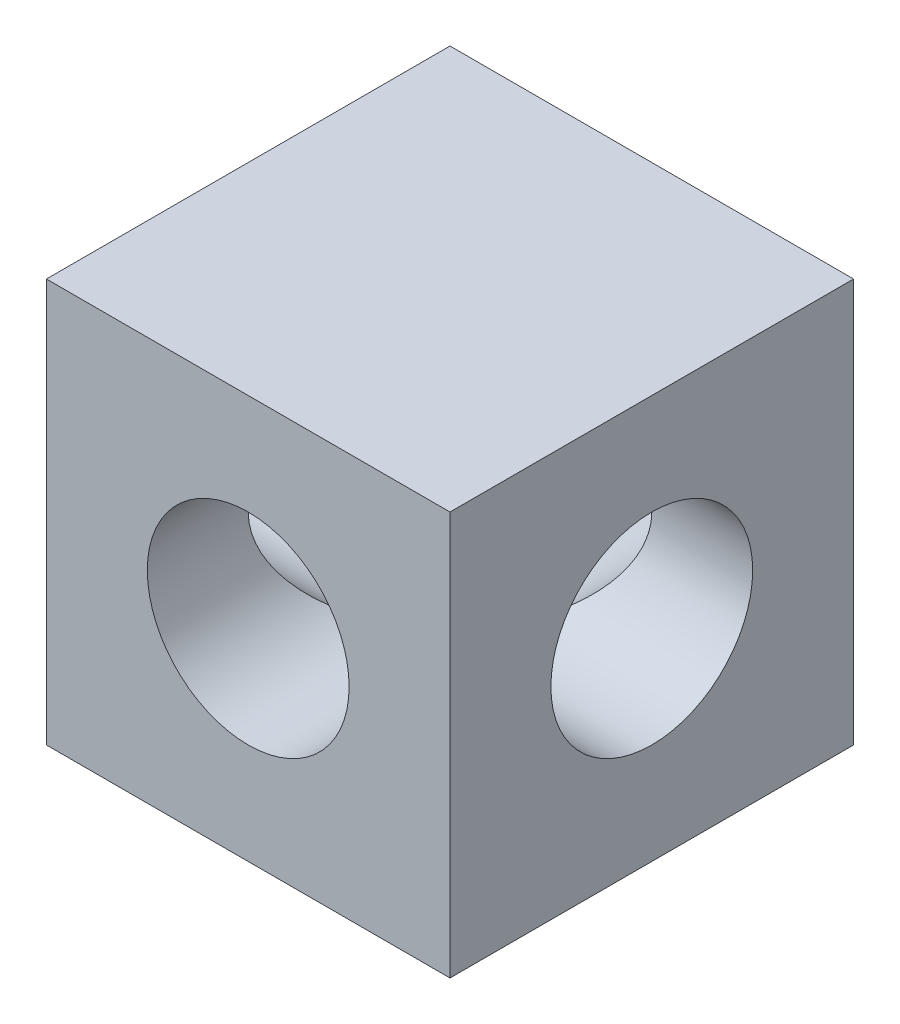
from build123d import *

# Parameters (mm, degrees)
SKIZZE1_W               = 19
SKIZZE1_H               = 19
LINEAR_AUSTRAGEN1_DEPTH = 9.5
SKIZZE2_W               = 19
SKIZZE2_H               = 4.75
BOHRUNG1_D              = 9.5


with BuildPart() as part:
    # Skizze1 → Linear austragen1 (new, symmetric)
    with BuildSketch(Plane.XZ.offset(-0.567926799)):
        Rectangle(SKIZZE1_W, SKIZZE1_H)
    extrude(amount=LINEAR_AUSTRAGEN1_DEPTH, both=True)

    # Skizze2 → Schnitt-Rotation1 (revolve, cut)
    with BuildSketch(Plane.XY, mode=Mode.PRIVATE) as schnitt_rotation1_sk:
        with Locations((0, 2.942926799)):
            Rectangle(SKIZZE2_W, SKIZZE2_H)
    revolve(schnitt_rotation1_sk.sketch.rotate(Axis((-9.5, 0.567926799, 0), (1, 0, 0)), 270), axis=Axis((-9.5, 0.567926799, 0), (1, 0, 0)), mode=Mode.SUBTRACT)

    # Bohrung1 (through all)
    with Locations(Plane(origin=(0, 0, -9.5), x_dir=(-1, 0, 0), z_dir=(0, 0, -1))):
        with Locations((0, 0.567926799)):
            Hole(BOHRUNG1_D / 2)


solid = part.part
